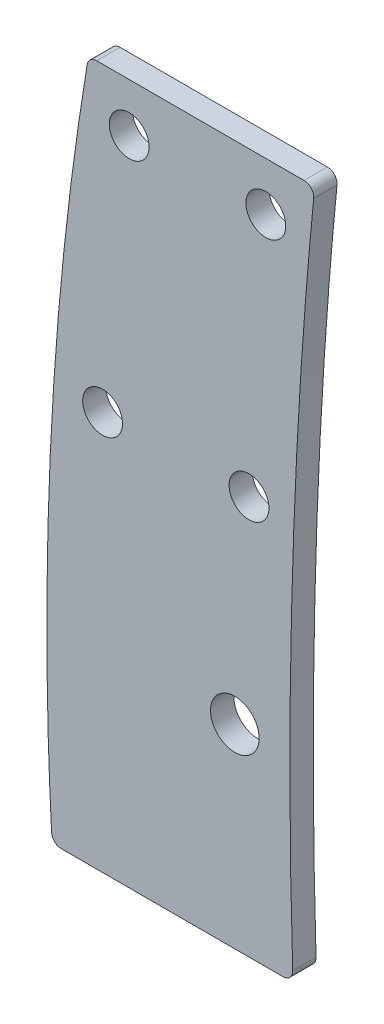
from build123d import *

# Parameters (mm, degrees)
BOSS_EXTRU_1_DEPTH                  = 2.3
CONG_1_R                            = 3.2
CONG_2_R                            = 0.8
ESQUISSE6_R                         = 1.5
ENL_V_MAT_EXTRU_2_DEPTH             = 4
CONG_4_R                            = 40
CONG_5_R                            = 55
CONG_6_R                            = 5
ESQUISSE7_OUTSIDE_W                 = 235.488
ESQUISSE7_OUTSIDE_H                 = 313.342
ENL_V_MAT_EXTRU_3_DEPTH             = 254.559151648
CONG_7_R                            = 1
BOSS_EXTRU_2_DEPTH                  = 0.1
DIAM_TRE_DU_PER_AGE_5_0_5_1_D       = 5
DIAM_TRE_DU_PER_AGE_5_0_5_1_DEPTH   = 60
DIAM_TRE_DU_PER_AGE_5_0_5_1_TIP     = 1.502151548
DIAM_TRE_DU_PER_AGE_4_1_4_1_1_D     = 4.1
DIAM_TRE_DU_PER_AGE_4_1_4_1_1_DEPTH = 60
DIAM_TRE_DU_PER_AGE_4_1_4_1_1_TIP   = 1.231764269


with BuildPart() as part:
    # Esquisse1 → Boss.-Extru.1 (new body)
    with BuildSketch(Plane.XY):
        with BuildLine():
            Line((-0.739497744, 9.26), (-0.739497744, 0))
            Line((-0.739497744, 0), (-8.739497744, 0))
            ThreePointArc((-8.739497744, 0), (-9.987816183, -0.086992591), (-11.21200252, -0.34628865))
            Line((-11.21200252, -0.34628865), (-15.724973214, -1.635717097))
            add(Edge.make_bspline(
                [(-15.724973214, -1.635717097), (-62.479329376, -14.994190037), (-34.146674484, -194.013963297)],
                knots=[0.059454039, 0.059454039, 0.059454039, 2.220460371, 2.220460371, 2.220460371], degree=2, weights=[1, 0.470884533, 1]))
            add(Edge.make_bspline(
                [(-34.146674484, -194.013963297), (27.242702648, -213.692623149), (101.257172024, -177.705354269)],
                knots=[3.821795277, 3.821795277, 3.821795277, 5.067449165, 5.067449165, 5.067449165], degree=2, weights=[1, 0.812232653, 1]))
            Line((101.257172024, -177.705354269), (109.260502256, -207.574189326))
            add(Edge.make_bspline(
                [(-52.426167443, -205.631123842), (16.317837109, -258.619397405), (109.260502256, -207.574189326)],
                knots=[0.50596565, 0.50596565, 0.50596565, 1.896752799, 1.896752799, 1.896752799], degree=2, weights=[1, 0.767801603, 1]))
            add(Edge.make_bspline(
                [(-19.682682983, 8.247626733), (-113.073085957, -18.435516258), (-52.426167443, -205.631123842)],
                knots=[0.109079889, 0.109079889, 0.109079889, 2.27251572, 2.27251572, 2.27251572], degree=2, weights=[1, 0.469812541, 1]))
            Line((-19.682682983, 8.247626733), (-0.739497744, 13.66))
            Line((-0.739497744, 13.66), (38.077925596, 22.123567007))
            ThreePointArc((38.077925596, 22.123567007), (19.707162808, 12.559642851), (-0.739497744, 9.26))
        make_face()
    extrude(amount=BOSS_EXTRU_1_DEPTH)

    # Cong_1
    cong_1_edges = [part.edges().sort_by_distance(p)[0] for p in [
        (-0.739497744, 9.26, 1.15),
    ]]
    fillet(cong_1_edges, radius=CONG_1_R)

    # Cong_2
    cong_2_edges = [part.edges().sort_by_distance(p)[0] for p in [
        (38.077925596, 22.123567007, 1.15),
    ]]
    fillet(cong_2_edges, radius=CONG_2_R)

    # Esquisse6 → Enl_v. mat.-Extru.2 (cut)
    with BuildSketch(Plane.XY.offset(2.3)):
        with Locations((13.852641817, 13.888758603)):
            Circle(ESQUISSE6_R)
    extrude(amount=-ENL_V_MAT_EXTRU_2_DEPTH, mode=Mode.SUBTRACT)

    # Cong_4
    cong_4_edges = [part.edges().sort_by_distance(p)[0] for p in [
        (-34.146674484, -194.013963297, 1.15),
    ]]
    fillet(cong_4_edges, radius=CONG_4_R)

    # Cong_5
    cong_5_edges = [part.edges().sort_by_distance(p)[0] for p in [
        (-52.426167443, -205.631123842, 1.15),
    ]]
    fillet(cong_5_edges, radius=CONG_5_R)

    # Cong_6
    cong_6_edges = [part.edges().sort_by_distance(p)[0] for p in [
        (109.260502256, -207.574189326, 1.15),
        (101.257172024, -177.705354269, 1.15),
    ]]
    fillet(cong_6_edges, radius=CONG_6_R)

    # Esquisse7 outside → Enl_v. mat.-Extru.3 (cut, through all)
    with BuildSketch(Plane.XY.offset(2.3)):
        with Locations((22.082, -103.959)):
            Rectangle(ESQUISSE7_OUTSIDE_W, ESQUISSE7_OUTSIDE_H)
        with BuildLine():
            Line((-63.69889629, -140.554103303), (-38.91976865, -140.554103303))
            add(Edge.make_bspline(
                [(-36.682332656, -68.554103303), (-40.188414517, -102.844799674), (-38.91976865, -140.554103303)],
                knots=[4.256144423, 4.256144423, 4.256144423, 4.872492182, 4.872492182, 4.872492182], degree=2, weights=[1, 0.952889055, 1]))
            Line((-36.682332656, -68.554103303), (-59.948756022, -68.554103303))
            add(Edge.make_bspline(
                [(-59.948756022, -68.554103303), (-65.825258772, -103.135515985), (-63.69889629, -140.554103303)],
                knots=[1.153492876, 1.153492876, 1.153492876, 1.717980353, 1.717980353, 1.717980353], degree=2, weights=[1, 0.96043295, 1]))
        make_face(mode=Mode.SUBTRACT)
    extrude(amount=-ENL_V_MAT_EXTRU_3_DEPTH, mode=Mode.SUBTRACT)

    # Cong_7
    cong_7_edges = [part.edges().sort_by_distance(p)[0] for p in [
        (-63.69889629, -140.554103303, 1.15),
        (-38.91976865, -140.554103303, 1.15),
        (-59.948756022, -68.554103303, 1.15),
        (-36.682332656, -68.554103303, 1.15),
    ]]
    fillet(cong_7_edges, radius=CONG_7_R)

    # Esquisse8 → Boss.-Extru.2 (add)
    with BuildSketch(Plane.XY.offset(2.3)):
        with BuildLine():
            Line((-62.752756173, -140.554103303), (-39.95301633, -140.554103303))
            ThreePointArc((-39.95301633, -140.554103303), (-39.234765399, -140.249887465), (-38.953521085, -139.522334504))
            add(Edge.make_bspline(
                [(-36.793272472, -69.653240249), (-40.114657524, -102.991197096), (-38.953521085, -139.522334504)],
                knots=[4.266322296, 4.266322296, 4.266322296, 4.863788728, 4.863788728, 4.863788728], degree=2, weights=[1, 0.955710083, 1]))
            ThreePointArc((-36.793272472, -69.653240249), (-37.047017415, -68.882961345), (-37.788346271, -68.554103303))
            Line((-37.788346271, -68.554103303), (-59.103019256, -68.554103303))
            ThreePointArc((-59.103019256, -68.554103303), (-59.749369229, -68.791062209), (-60.089402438, -69.38963988))
            add(Edge.make_bspline(
                [(-60.089402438, -69.38963988), (-65.718498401, -103.150615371), (-63.751303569, -139.607983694)],
                knots=[1.160488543, 1.160488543, 1.160488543, 1.710652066, 1.710652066, 1.710652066], degree=2, weights=[1, 0.962402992, 1]))
            ThreePointArc((-63.751303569, -139.607983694), (-63.440549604, -140.280009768), (-62.752756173, -140.554103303))
        make_face()
    extrude(amount=BOSS_EXTRU_2_DEPTH)

    # Diam_tre du per_age _5.0 _5_1
    with Locations(Plane.XY.offset(2.4)):
        with Locations((-44.905431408, -120.554103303)):
            Hole(DIAM_TRE_DU_PER_AGE_5_0_5_1_D / 2, depth=DIAM_TRE_DU_PER_AGE_5_0_5_1_DEPTH)
            with Locations((0, 0, -(DIAM_TRE_DU_PER_AGE_5_0_5_1_DEPTH + DIAM_TRE_DU_PER_AGE_5_0_5_1_TIP / 2))):  # 118° drill point
                Cone(0, DIAM_TRE_DU_PER_AGE_5_0_5_1_D / 2, DIAM_TRE_DU_PER_AGE_5_0_5_1_TIP, mode=Mode.SUBTRACT)

    # Diam_tre du per_age _4.1 _4.1_1
    with Locations(Plane.XY.offset(2.4)):
        with Locations((-55.770431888, -73.554103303), (-41.718958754, -73.554103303), (-43.448705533, -99.554103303), (-58.50385532, -99.554103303)):
            Hole(DIAM_TRE_DU_PER_AGE_4_1_4_1_1_D / 2, depth=DIAM_TRE_DU_PER_AGE_4_1_4_1_1_DEPTH)
            with Locations((0, 0, -(DIAM_TRE_DU_PER_AGE_4_1_4_1_1_DEPTH + DIAM_TRE_DU_PER_AGE_4_1_4_1_1_TIP / 2))):  # 118° drill point
                Cone(0, DIAM_TRE_DU_PER_AGE_4_1_4_1_1_D / 2, DIAM_TRE_DU_PER_AGE_4_1_4_1_1_TIP, mode=Mode.SUBTRACT)


solid = part.part
